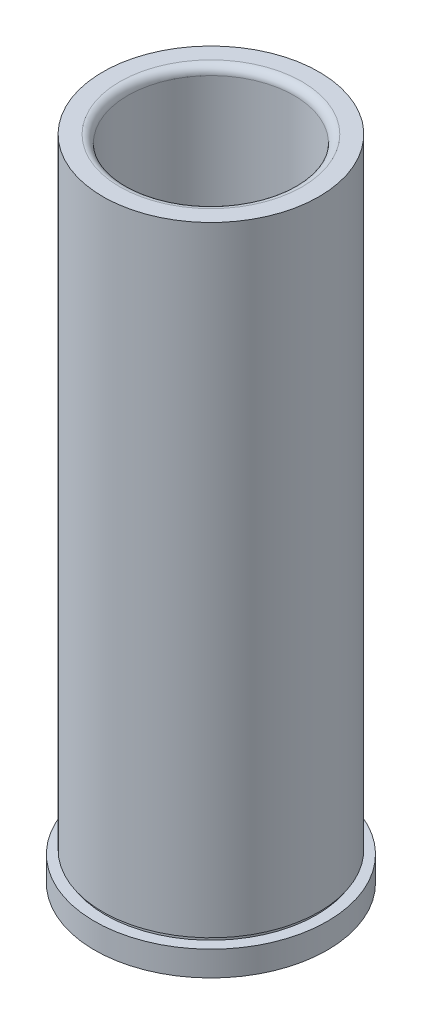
from build123d import *

# Parameters (mm, degrees)
FILLET1_R = 1.524


with BuildPart() as part:
    # Sketch1 → Revolve1 (revolve)
    with BuildSketch(Plane.XY, mode=Mode.PRIVATE) as revolve1_sk:
        with BuildLine():
            Line((-15.88135, 123.825), (-15.88135, 60.325))
            ThreePointArc((-15.88135, 60.325), (-16.779375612, 59.953025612), (-17.15135, 59.055))
            Line((-17.15135, 59.055), (-17.15135, 0.79375))
            Line((-17.15135, 0.79375), (-17.9451, 0))
            Line((-17.9451, 0), (-22.225, 0))
            Line((-22.225, 0), (-22.225, 4.7625))
            Line((-22.225, 4.7625), (-20.13585, 4.7625))
            Line((-20.13585, 4.7625), (-20.13585, 5.5245))
            Line((-20.13585, 5.5245), (-20.64385, 5.5245))
            Line((-20.64385, 5.5245), (-20.64385, 123.825))
            Line((-20.64385, 123.825), (-15.88135, 123.825))
        make_face()
    revolve(revolve1_sk.sketch.rotate(Axis((0, -1000, 0), (0, 1, 0)), 180), axis=Axis((0, -1000, 0), (0, 1, 0)))

    # Fillet1
    fillet1_edges = [part.edges().sort_by_distance(p)[0] for p in [
        (-15.88135, 123.825, 0),
    ]]
    fillet(fillet1_edges, radius=FILLET1_R)


solid = part.part
